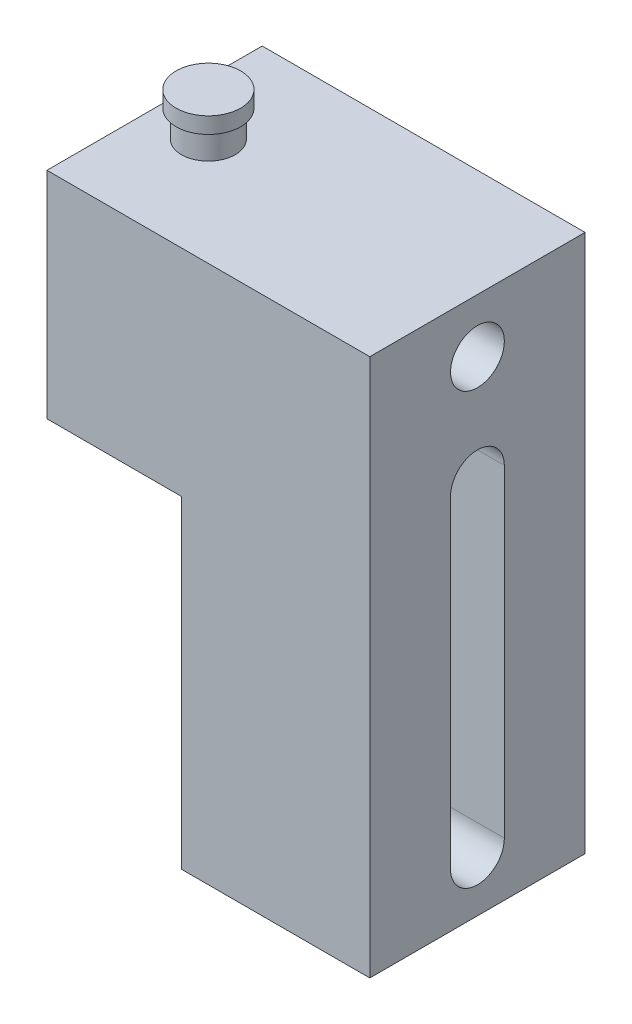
from build123d import *

# Parameters (mm, degrees)
BASE_EXTRUSION_DEPTH    = 40
ESQUISSE2_R             = 5
BOSS_EXTRU_1_DEPTH      = 5
ESQUISSE5_R             = 5
ENL_V_MAT_EXTRU_1_DEPTH = 10
ENL_V_MAT_EXTRU_2_DEPTH = 20
ESQUISSE7_R             = 6
BOSS_EXTRU_2_DEPTH      = 3


with BuildPart() as part:
    # Esquisse1 → Base-Extrusion (new body)
    with BuildSketch(Plane.XY):
        Polygon((0, 0), (60, 0), (60, -100), (25, -100), (25, -40), (0, -40), align=None)
    extrude(amount=BASE_EXTRUSION_DEPTH)

    # Esquisse2 → Boss.-Extru.1 (add)
    with BuildSketch(Plane(origin=(0, 0, 0), x_dir=(-1, 0, 0), z_dir=(0, 1, 0))):
        with Locations(Location((-10, 20, 0), (0, 0, 270))):
            Circle(ESQUISSE2_R)
    extrude(amount=BOSS_EXTRU_1_DEPTH)

    # Esquisse5 → Enl_v. mat.-Extru.1 (cut)
    with BuildSketch(Plane(origin=(60, 0, 0), x_dir=(0, 0, -1), z_dir=(1, 0, 0))):
        with Locations(Location((-20, -10, 0), (0, 0, 90))):
            Circle(ESQUISSE5_R)
    extrude(amount=-ENL_V_MAT_EXTRU_1_DEPTH, mode=Mode.SUBTRACT)

    # Esquisse6 → Enl_v. mat.-Extru.2 (cut)
    with BuildSketch(Plane(origin=(60, 0, 0), x_dir=(0, 0, -1), z_dir=(1, 0, 0))):
        with BuildLine():
            Line((-25, -90), (-25, -30))
            ThreePointArc((-25, -30), (-20, -25), (-15, -30))
            Line((-15, -30), (-15, -90))
            ThreePointArc((-15, -90), (-20, -95), (-25, -90))
        make_face()
    extrude(amount=-ENL_V_MAT_EXTRU_2_DEPTH, mode=Mode.SUBTRACT)

    # Esquisse7 → Boss.-Extru.2 (add)
    with BuildSketch(Plane(origin=(0, 5, 0), x_dir=(-1, 0, 0), z_dir=(0, 1, 0))):
        with Locations(Location((-10, 20, 0), (0, 0, 90))):
            Circle(ESQUISSE7_R)
    extrude(amount=BOSS_EXTRU_2_DEPTH)


solid = part.part
